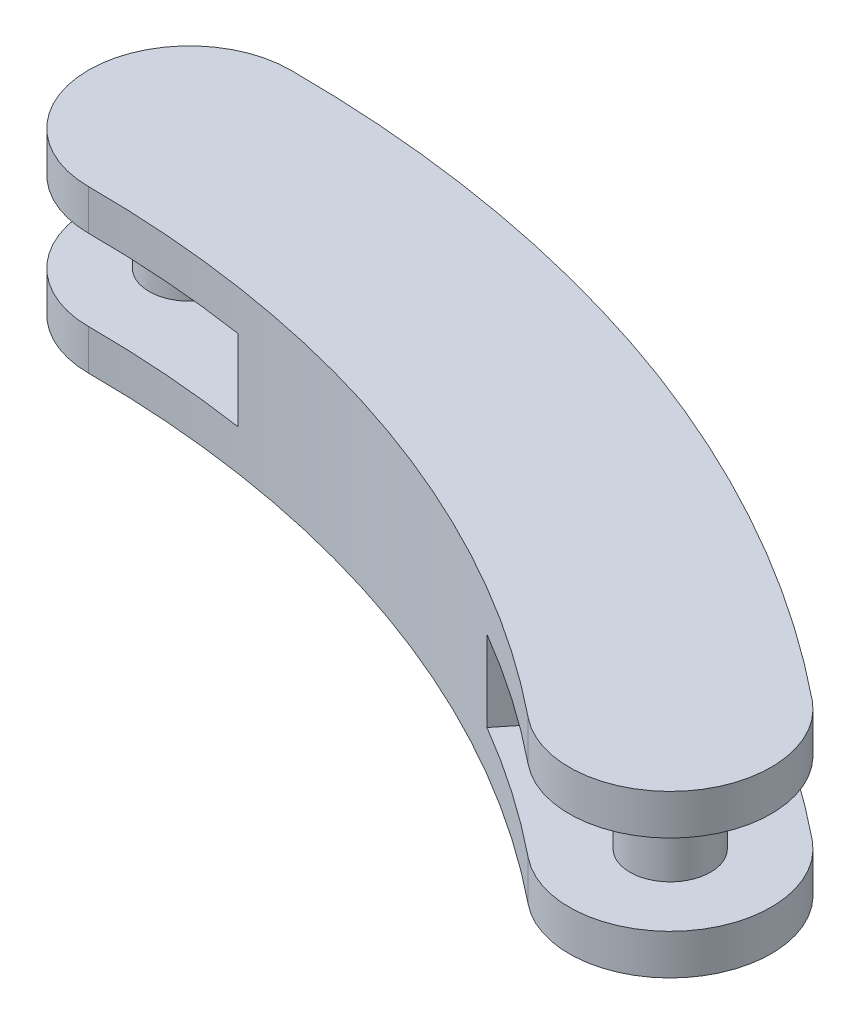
from build123d import *

# Parameters (mm, degrees)
SKETCH1_R                           = 9.999999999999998
SKETCH1_R_2                         = 10.000000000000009
BOSS_EXTRUDE1_DEPTH                 = 40
CUT_EXTRUDE1_DEPTH                  = 232.0432859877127
CUT_EXTRUDE2_REACH                  = 227.707
CUT_EXTRUDE2_END_RADIUS             = 317.93076923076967
CUT_EXTRUDE2_DIRECTION_2_REACH      = 227.707
CUT_EXTRUDE2_DIRECTION_2_END_RADIUS = 267.9307692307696
SKETCH14_R                          = 9.999999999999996
SKETCH14_R_2                        = 10.000000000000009
BOSS_EXTRUDE2_DEPTH                 = 40


with BuildPart() as part:
    # Sketch1 → Boss-Extrude1 (new body)
    with BuildSketch(Plane(origin=(0, 0, 0), x_dir=(1, 0, 0), z_dir=(0, 1, 0))):
        with BuildLine():
            ThreePointArc((1.641e-14, 39.99999999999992), (89.24456466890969, 24.699998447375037), (168.29663086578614, -19.45261416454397))
            ThreePointArc((168.29663086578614, -19.45261416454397), (203.45261416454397, -15.703369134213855), (199.70336913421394, 19.45261416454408))
            ThreePointArc((199.70336913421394, 19.45261416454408), (105.89897224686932, 71.84478297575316), (1.947e-14, 89.99999999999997))
            ThreePointArc((1.947e-14, 89.99999999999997), (-24.99999999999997, 65), (1.641e-14, 39.99999999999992))
        make_face()
        with Locations(Location((0, 65, 0), (0, 0, 270))):
            Circle(SKETCH1_R, mode=Mode.SUBTRACT)
        with Locations(Location((184, 0, 0), (0, 0, 270))):
            Circle(SKETCH1_R_2, mode=Mode.SUBTRACT)
    extrude(amount=BOSS_EXTRUDE1_DEPTH)

    # Sketch3 → Cut-Extrude1 (cut, through all)
    with BuildSketch(Plane.XY):
        Polygon((-25.000000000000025, 30), (39.99999999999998, 30), (39.99999999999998, 9.999999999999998), (-25.00000000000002, 9.999999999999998), align=None)
    extrude(amount=-CUT_EXTRUDE1_DEPTH, mode=Mode.SUBTRACT)

    # Cut-Extrude2: up to this cylinder (the profile starts inside it)
    cut_extrude2_end = Plane(origin=(0, 20, 227.93076923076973), z_dir=(0, -1, 0)) * Cylinder(CUT_EXTRUDE2_END_RADIUS, 1092.2755384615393, mode=Mode.PRIVATE)
    # Sketch5 → Cut-Extrude2 (cut, up to the surface)
    with BuildSketch(Plane(origin=(168.2966308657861, 40, 19.452614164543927), x_dir=(-0.7781045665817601, 0, -0.6281347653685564), z_dir=(0.6281347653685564, 0, -0.7781045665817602)), mode=Mode.PRIVATE) as cut_extrude2_sk1:
        Polygon((39.99999999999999, -9.999999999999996), (-78.72610444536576, -10), (-78.72610444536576, -30), (39.99999999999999, -30), align=None)
    cut_extrude2_tool1 = extrude(cut_extrude2_sk1.sketch, amount=CUT_EXTRUDE2_REACH, mode=Mode.PRIVATE) & cut_extrude2_end
    add(cut_extrude2_tool1.solids().sort_by_distance((183.36311, 20, 31.61522))[0], mode=Mode.SUBTRACT)

    # Cut-Extrude2 direction 2: up to this cylinder (the profile starts outside it)
    cut_extrude2_direction_2_end = Plane(origin=(0, 20, 227.93076923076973), z_dir=(0, -1, 0)) * Cylinder(CUT_EXTRUDE2_DIRECTION_2_END_RADIUS, 992.2755384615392, mode=Mode.PRIVATE)
    # Sketch5 → Cut-Extrude2 direction 2 (cut, up to the surface)
    with BuildSketch(Plane(origin=(168.2966308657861, 40, 19.452614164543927), x_dir=(-0.7781045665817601, 0, -0.6281347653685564), z_dir=(0.6281347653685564, 0, -0.7781045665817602)), mode=Mode.PRIVATE) as cut_extrude2_direction_2_sk1:
        Polygon((39.99999999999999, -9.999999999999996), (-78.72610444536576, -10), (-78.72610444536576, -30), (39.99999999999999, -30), align=None)
    cut_extrude2_direction_2_tool1 = extrude(cut_extrude2_direction_2_sk1.sketch, amount=-CUT_EXTRUDE2_DIRECTION_2_REACH, mode=Mode.PRIVATE) - cut_extrude2_direction_2_end
    add(cut_extrude2_direction_2_tool1.solids().sort_by_distance((183.36311, 20, 31.61522))[0], mode=Mode.SUBTRACT)
    add(cut_extrude2_direction_2_tool1.solids().sort_by_distance((183.36311, 20, 31.61522))[1], mode=Mode.SUBTRACT)

    # Sketch14 → Boss-Extrude2 (add, through all)
    with BuildSketch(Plane(origin=(0, 40, 0), x_dir=(1, 0, 0), z_dir=(0, 1, 0))):
        with Locations(Location((0, 65, 0), (0, 0, 90))):
            Circle(SKETCH14_R)
        with Locations(Location((184, 2.429e-14, 0), (0, 0, 270))):
            Circle(SKETCH14_R_2)
    extrude(amount=-BOSS_EXTRUDE2_DEPTH)


solid = part.part
